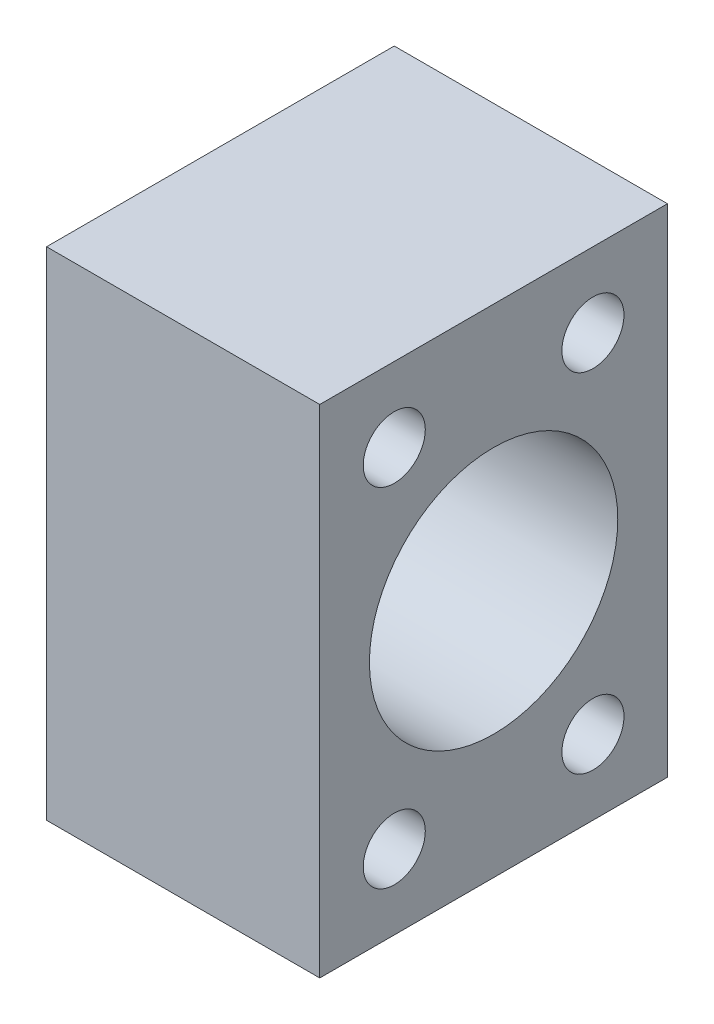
ISO-10303-21;
HEADER;
FILE_DESCRIPTION(('STEP AP214'),'2;1');
FILE_NAME('part.step','',(''),(''),'','','');
FILE_SCHEMA(('AUTOMOTIVE_DESIGN { 1 0 10303 214 1 1 1 1 }'));
ENDSEC;
DATA;
#1=APPLICATION_CONTEXT('core data for automotive mechanical design processes');
#2=APPLICATION_PROTOCOL_DEFINITION('international standard','automotive_design',2000,#1);
#3=PRODUCT_CONTEXT('',#1,'mechanical');
#4=PRODUCT('Part','Part','',(#3));
#5=PRODUCT_RELATED_PRODUCT_CATEGORY('part','',(#4));
#6=PRODUCT_DEFINITION_FORMATION('','',#4);
#7=PRODUCT_DEFINITION_CONTEXT('part definition',#1,'design');
#8=PRODUCT_DEFINITION('design','',#6,#7);
#9=PRODUCT_DEFINITION_SHAPE('','',#8);
#10=(LENGTH_UNIT() NAMED_UNIT(*) SI_UNIT(.MILLI.,.METRE.));
#11=(NAMED_UNIT(*) PLANE_ANGLE_UNIT() SI_UNIT($,.RADIAN.));
#12=(NAMED_UNIT(*) SI_UNIT($,.STERADIAN.) SOLID_ANGLE_UNIT());
#13=UNCERTAINTY_MEASURE_WITH_UNIT(LENGTH_MEASURE(1.E-05),#10,'distance_accuracy_value','');
#14=(GEOMETRIC_REPRESENTATION_CONTEXT(3) GLOBAL_UNCERTAINTY_ASSIGNED_CONTEXT((#13)) GLOBAL_UNIT_ASSIGNED_CONTEXT((#10,
#11,#12)) REPRESENTATION_CONTEXT('',''));
#15=CARTESIAN_POINT('',(0.,0.,0.));
#16=DIRECTION('',(0.,0.,1.));
#17=DIRECTION('',(1.,0.,0.));
#18=AXIS2_PLACEMENT_3D('',#15,#16,#17);
#19=CARTESIAN_POINT('',(17.4625,-31.75,-22.225));
#20=DIRECTION('',(1.,0.,0.));
#21=DIRECTION('',(0.,0.,-1.));
#22=AXIS2_PLACEMENT_3D('',#19,#20,#21);
#23=PLANE('',#22);
#24=CARTESIAN_POINT('',(17.4625,-22.225,12.7));
#25=DIRECTION('',(1.,0.,0.));
#26=DIRECTION('',(0.,0.,-1.));
#27=AXIS2_PLACEMENT_3D('',#24,#25,#26);
#28=CIRCLE('',#27,3.96874999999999);
#29=CARTESIAN_POINT('',(17.4625,-22.225,8.73125000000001));
#30=VERTEX_POINT('',#29);
#31=EDGE_CURVE('E136',#30,#30,#28,.T.);
#32=ORIENTED_EDGE('',*,*,#31,.F.);
#33=EDGE_LOOP('',(#32));
#34=FACE_BOUND('',#33,.T.);
#35=CARTESIAN_POINT('',(17.4625,-22.225,-12.7));
#36=DIRECTION('',(1.,0.,0.));
#37=DIRECTION('',(0.,0.,-1.));
#38=AXIS2_PLACEMENT_3D('',#35,#36,#37);
#39=CIRCLE('',#38,3.96874999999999);
#40=CARTESIAN_POINT('',(17.4625,-22.225,-16.66875));
#41=VERTEX_POINT('',#40);
#42=EDGE_CURVE('E130',#41,#41,#39,.T.);
#43=ORIENTED_EDGE('',*,*,#42,.F.);
#44=EDGE_LOOP('',(#43));
#45=FACE_BOUND('',#44,.T.);
#46=CARTESIAN_POINT('',(17.4625,22.225,-12.7));
#47=DIRECTION('',(1.,0.,0.));
#48=DIRECTION('',(0.,0.,-1.));
#49=AXIS2_PLACEMENT_3D('',#46,#47,#48);
#50=CIRCLE('',#49,3.96874999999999);
#51=CARTESIAN_POINT('',(17.4625,22.225,-16.66875));
#52=VERTEX_POINT('',#51);
#53=EDGE_CURVE('E124',#52,#52,#50,.T.);
#54=ORIENTED_EDGE('',*,*,#53,.F.);
#55=EDGE_LOOP('',(#54));
#56=FACE_BOUND('',#55,.T.);
#57=CARTESIAN_POINT('',(17.4625,22.225,12.7));
#58=DIRECTION('',(1.,0.,0.));
#59=DIRECTION('',(0.,0.,-1.));
#60=AXIS2_PLACEMENT_3D('',#57,#58,#59);
#61=CIRCLE('',#60,3.96874999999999);
#62=CARTESIAN_POINT('',(17.4625,22.225,8.73125000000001));
#63=VERTEX_POINT('',#62);
#64=EDGE_CURVE('E118',#63,#63,#61,.T.);
#65=ORIENTED_EDGE('',*,*,#64,.F.);
#66=EDGE_LOOP('',(#65));
#67=FACE_BOUND('',#66,.T.);
#68=DIRECTION('',(0.,1.,0.));
#69=VECTOR('',#68,1.);
#70=CARTESIAN_POINT('',(17.4625,31.75,-22.225));
#71=LINE('',#70,#69);
#72=CARTESIAN_POINT('',(17.4625,-31.75,-22.225));
#73=VERTEX_POINT('',#72);
#74=CARTESIAN_POINT('',(17.4625,31.75,-22.225));
#75=VERTEX_POINT('',#74);
#76=EDGE_CURVE('E83',#73,#75,#71,.T.);
#77=ORIENTED_EDGE('',*,*,#76,.T.);
#78=DIRECTION('',(0.,0.,1.));
#79=VECTOR('',#78,1.);
#80=CARTESIAN_POINT('',(17.4625,31.75,22.225));
#81=LINE('',#80,#79);
#82=CARTESIAN_POINT('',(17.4625,31.75,22.225));
#83=VERTEX_POINT('',#82);
#84=EDGE_CURVE('E78',#75,#83,#81,.T.);
#85=ORIENTED_EDGE('',*,*,#84,.T.);
#86=DIRECTION('',(0.,-1.,0.));
#87=VECTOR('',#86,1.);
#88=CARTESIAN_POINT('',(17.4625,31.75,22.225));
#89=LINE('',#88,#87);
#90=CARTESIAN_POINT('',(17.4625,-31.75,22.225));
#91=VERTEX_POINT('',#90);
#92=EDGE_CURVE('E81',#83,#91,#89,.T.);
#93=ORIENTED_EDGE('',*,*,#92,.T.);
#94=DIRECTION('',(0.,0.,-1.));
#95=VECTOR('',#94,1.);
#96=CARTESIAN_POINT('',(17.4625,-31.75,22.225));
#97=LINE('',#96,#95);
#98=EDGE_CURVE('E48',#91,#73,#97,.T.);
#99=ORIENTED_EDGE('',*,*,#98,.T.);
#100=EDGE_LOOP('',(#77,#85,#93,#99));
#101=FACE_BOUND('',#100,.T.);
#102=CARTESIAN_POINT('',(17.4625,0.,0.));
#103=DIRECTION('',(1.,0.,0.));
#104=DIRECTION('',(0.,0.,-1.));
#105=AXIS2_PLACEMENT_3D('',#102,#103,#104);
#106=CIRCLE('',#105,15.875);
#107=CARTESIAN_POINT('',(17.4625,0.,-15.875));
#108=VERTEX_POINT('',#107);
#109=EDGE_CURVE('E98',#108,#108,#106,.T.);
#110=ORIENTED_EDGE('',*,*,#109,.F.);
#111=EDGE_LOOP('',(#110));
#112=FACE_BOUND('',#111,.T.);
#113=ADVANCED_FACE('F31',(#34,#45,#56,#67,#101,#112),#23,.T.);
#114=CARTESIAN_POINT('',(-17.4625,-31.75,-22.225));
#115=DIRECTION('',(1.,0.,0.));
#116=DIRECTION('',(0.,0.,-1.));
#117=AXIS2_PLACEMENT_3D('',#114,#115,#116);
#118=PLANE('',#117);
#119=CARTESIAN_POINT('',(-17.4625,-22.225,12.7));
#120=DIRECTION('',(1.,0.,0.));
#121=DIRECTION('',(0.,0.,-1.));
#122=AXIS2_PLACEMENT_3D('',#119,#120,#121);
#123=CIRCLE('',#122,3.96874999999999);
#124=CARTESIAN_POINT('',(-17.4625,-22.225,8.73125));
#125=VERTEX_POINT('',#124);
#126=EDGE_CURVE('E133',#125,#125,#123,.T.);
#127=ORIENTED_EDGE('',*,*,#126,.T.);
#128=EDGE_LOOP('',(#127));
#129=FACE_BOUND('',#128,.T.);
#130=CARTESIAN_POINT('',(-17.4625,-22.225,-12.7));
#131=DIRECTION('',(1.,0.,0.));
#132=DIRECTION('',(0.,0.,-1.));
#133=AXIS2_PLACEMENT_3D('',#130,#131,#132);
#134=CIRCLE('',#133,3.96874999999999);
#135=CARTESIAN_POINT('',(-17.4625,-22.225,-16.66875));
#136=VERTEX_POINT('',#135);
#137=EDGE_CURVE('E127',#136,#136,#134,.T.);
#138=ORIENTED_EDGE('',*,*,#137,.T.);
#139=EDGE_LOOP('',(#138));
#140=FACE_BOUND('',#139,.T.);
#141=CARTESIAN_POINT('',(-17.4625,22.225,-12.7));
#142=DIRECTION('',(1.,0.,0.));
#143=DIRECTION('',(0.,0.,-1.));
#144=AXIS2_PLACEMENT_3D('',#141,#142,#143);
#145=CIRCLE('',#144,3.96874999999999);
#146=CARTESIAN_POINT('',(-17.4625,22.225,-16.66875));
#147=VERTEX_POINT('',#146);
#148=EDGE_CURVE('E121',#147,#147,#145,.T.);
#149=ORIENTED_EDGE('',*,*,#148,.T.);
#150=EDGE_LOOP('',(#149));
#151=FACE_BOUND('',#150,.T.);
#152=CARTESIAN_POINT('',(-17.4625,22.225,12.7));
#153=DIRECTION('',(1.,0.,0.));
#154=DIRECTION('',(0.,0.,-1.));
#155=AXIS2_PLACEMENT_3D('',#152,#153,#154);
#156=CIRCLE('',#155,3.96874999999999);
#157=CARTESIAN_POINT('',(-17.4625,22.225,8.73125));
#158=VERTEX_POINT('',#157);
#159=EDGE_CURVE('E113',#158,#158,#156,.T.);
#160=ORIENTED_EDGE('',*,*,#159,.T.);
#161=EDGE_LOOP('',(#160));
#162=FACE_BOUND('',#161,.T.);
#163=DIRECTION('',(0.,1.,0.));
#164=VECTOR('',#163,1.);
#165=CARTESIAN_POINT('',(-17.4625,31.75,-22.225));
#166=LINE('',#165,#164);
#167=CARTESIAN_POINT('',(-17.4625,-31.75,-22.225));
#168=VERTEX_POINT('',#167);
#169=CARTESIAN_POINT('',(-17.4625,31.75,-22.225));
#170=VERTEX_POINT('',#169);
#171=EDGE_CURVE('E95',#168,#170,#166,.T.);
#172=ORIENTED_EDGE('',*,*,#171,.F.);
#173=DIRECTION('',(0.,0.,-1.));
#174=VECTOR('',#173,1.);
#175=CARTESIAN_POINT('',(-17.4625,-31.75,22.225));
#176=LINE('',#175,#174);
#177=CARTESIAN_POINT('',(-17.4625,-31.75,22.225));
#178=VERTEX_POINT('',#177);
#179=EDGE_CURVE('E71',#178,#168,#176,.T.);
#180=ORIENTED_EDGE('',*,*,#179,.F.);
#181=DIRECTION('',(0.,-1.,0.));
#182=VECTOR('',#181,1.);
#183=CARTESIAN_POINT('',(-17.4625,31.75,22.225));
#184=LINE('',#183,#182);
#185=CARTESIAN_POINT('',(-17.4625,31.75,22.225));
#186=VERTEX_POINT('',#185);
#187=EDGE_CURVE('E65',#186,#178,#184,.T.);
#188=ORIENTED_EDGE('',*,*,#187,.F.);
#189=DIRECTION('',(0.,0.,1.));
#190=VECTOR('',#189,1.);
#191=CARTESIAN_POINT('',(-17.4625,31.75,22.225));
#192=LINE('',#191,#190);
#193=EDGE_CURVE('E87',#170,#186,#192,.T.);
#194=ORIENTED_EDGE('',*,*,#193,.F.);
#195=EDGE_LOOP('',(#172,#180,#188,#194));
#196=FACE_BOUND('',#195,.T.);
#197=CARTESIAN_POINT('',(-17.4625,0.,0.));
#198=DIRECTION('',(1.,0.,0.));
#199=DIRECTION('',(0.,0.,-1.));
#200=AXIS2_PLACEMENT_3D('',#197,#198,#199);
#201=CIRCLE('',#200,15.875);
#202=CARTESIAN_POINT('',(-17.4625,0.,-15.875));
#203=VERTEX_POINT('',#202);
#204=EDGE_CURVE('E110',#203,#203,#201,.T.);
#205=ORIENTED_EDGE('',*,*,#204,.T.);
#206=EDGE_LOOP('',(#205));
#207=FACE_BOUND('',#206,.T.);
#208=ADVANCED_FACE('F106',(#129,#140,#151,#162,#196,#207),#118,.F.);
#209=CARTESIAN_POINT('',(17.4625,31.75,-22.225));
#210=DIRECTION('',(0.,0.,1.));
#211=DIRECTION('',(0.,-1.,0.));
#212=AXIS2_PLACEMENT_3D('',#209,#210,#211);
#213=PLANE('',#212);
#214=ORIENTED_EDGE('',*,*,#171,.T.);
#215=DIRECTION('',(-1.,0.,0.));
#216=VECTOR('',#215,1.);
#217=CARTESIAN_POINT('',(17.4625,31.75,-22.225));
#218=LINE('',#217,#216);
#219=EDGE_CURVE('E11',#75,#170,#218,.T.);
#220=ORIENTED_EDGE('',*,*,#219,.F.);
#221=ORIENTED_EDGE('',*,*,#76,.F.);
#222=DIRECTION('',(-1.,0.,0.));
#223=VECTOR('',#222,1.);
#224=CARTESIAN_POINT('',(17.4625,-31.75,-22.225));
#225=LINE('',#224,#223);
#226=EDGE_CURVE('E91',#73,#168,#225,.T.);
#227=ORIENTED_EDGE('',*,*,#226,.T.);
#228=EDGE_LOOP('',(#214,#220,#221,#227));
#229=FACE_BOUND('',#228,.T.);
#230=ADVANCED_FACE('F33',(#229),#213,.F.);
#231=CARTESIAN_POINT('',(17.4625,31.75,22.225));
#232=DIRECTION('',(0.,-1.,0.));
#233=DIRECTION('',(0.,0.,-1.));
#234=AXIS2_PLACEMENT_3D('',#231,#232,#233);
#235=PLANE('',#234);
#236=ORIENTED_EDGE('',*,*,#193,.T.);
#237=DIRECTION('',(-1.,0.,0.));
#238=VECTOR('',#237,1.);
#239=CARTESIAN_POINT('',(17.4625,31.75,22.225));
#240=LINE('',#239,#238);
#241=EDGE_CURVE('E40',#83,#186,#240,.T.);
#242=ORIENTED_EDGE('',*,*,#241,.F.);
#243=ORIENTED_EDGE('',*,*,#84,.F.);
#244=ORIENTED_EDGE('',*,*,#219,.T.);
#245=EDGE_LOOP('',(#236,#242,#243,#244));
#246=FACE_BOUND('',#245,.T.);
#247=ADVANCED_FACE('F86',(#246),#235,.F.);
#248=CARTESIAN_POINT('',(17.4625,31.75,22.225));
#249=DIRECTION('',(0.,0.,-1.));
#250=DIRECTION('',(-1.,0.,0.));
#251=AXIS2_PLACEMENT_3D('',#248,#249,#250);
#252=PLANE('',#251);
#253=ORIENTED_EDGE('',*,*,#187,.T.);
#254=DIRECTION('',(-1.,0.,0.));
#255=VECTOR('',#254,1.);
#256=CARTESIAN_POINT('',(17.4625,-31.75,22.225));
#257=LINE('',#256,#255);
#258=EDGE_CURVE('E88',#91,#178,#257,.T.);
#259=ORIENTED_EDGE('',*,*,#258,.F.);
#260=ORIENTED_EDGE('',*,*,#92,.F.);
#261=ORIENTED_EDGE('',*,*,#241,.T.);
#262=EDGE_LOOP('',(#253,#259,#260,#261));
#263=FACE_BOUND('',#262,.T.);
#264=ADVANCED_FACE('F89',(#263),#252,.F.);
#265=CARTESIAN_POINT('',(17.4625,-31.75,22.225));
#266=DIRECTION('',(0.,1.,0.));
#267=DIRECTION('',(0.,0.,1.));
#268=AXIS2_PLACEMENT_3D('',#265,#266,#267);
#269=PLANE('',#268);
#270=ORIENTED_EDGE('',*,*,#179,.T.);
#271=ORIENTED_EDGE('',*,*,#226,.F.);
#272=ORIENTED_EDGE('',*,*,#98,.F.);
#273=ORIENTED_EDGE('',*,*,#258,.T.);
#274=EDGE_LOOP('',(#270,#271,#272,#273));
#275=FACE_BOUND('',#274,.T.);
#276=ADVANCED_FACE('F103',(#275),#269,.F.);
#277=CARTESIAN_POINT('',(17.4625,0.,0.));
#278=DIRECTION('',(-1.,0.,0.));
#279=DIRECTION('',(0.,0.,1.));
#280=AXIS2_PLACEMENT_3D('',#277,#278,#279);
#281=CYLINDRICAL_SURFACE('',#280,15.875);
#282=ORIENTED_EDGE('',*,*,#109,.T.);
#283=EDGE_LOOP('',(#282));
#284=FACE_BOUND('',#283,.T.);
#285=ORIENTED_EDGE('',*,*,#204,.F.);
#286=EDGE_LOOP('',(#285));
#287=FACE_BOUND('',#286,.T.);
#288=ADVANCED_FACE('F154',(#284,#287),#281,.F.);
#289=CARTESIAN_POINT('',(17.4625,22.225,12.7));
#290=DIRECTION('',(1.,0.,0.));
#291=DIRECTION('',(0.,0.,-1.));
#292=AXIS2_PLACEMENT_3D('',#289,#290,#291);
#293=CYLINDRICAL_SURFACE('',#292,3.96874999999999);
#294=ORIENTED_EDGE('',*,*,#159,.F.);
#295=EDGE_LOOP('',(#294));
#296=FACE_BOUND('',#295,.T.);
#297=ORIENTED_EDGE('',*,*,#64,.T.);
#298=EDGE_LOOP('',(#297));
#299=FACE_BOUND('',#298,.T.);
#300=ADVANCED_FACE('F151',(#296,#299),#293,.F.);
#301=CARTESIAN_POINT('',(17.4625,22.225,-12.7));
#302=DIRECTION('',(1.,0.,0.));
#303=DIRECTION('',(0.,0.,-1.));
#304=AXIS2_PLACEMENT_3D('',#301,#302,#303);
#305=CYLINDRICAL_SURFACE('',#304,3.96874999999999);
#306=ORIENTED_EDGE('',*,*,#148,.F.);
#307=EDGE_LOOP('',(#306));
#308=FACE_BOUND('',#307,.T.);
#309=ORIENTED_EDGE('',*,*,#53,.T.);
#310=EDGE_LOOP('',(#309));
#311=FACE_BOUND('',#310,.T.);
#312=ADVANCED_FACE('F153',(#308,#311),#305,.F.);
#313=CARTESIAN_POINT('',(17.4625,-22.225,-12.7));
#314=DIRECTION('',(1.,0.,0.));
#315=DIRECTION('',(0.,0.,-1.));
#316=AXIS2_PLACEMENT_3D('',#313,#314,#315);
#317=CYLINDRICAL_SURFACE('',#316,3.96874999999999);
#318=ORIENTED_EDGE('',*,*,#137,.F.);
#319=EDGE_LOOP('',(#318));
#320=FACE_BOUND('',#319,.T.);
#321=ORIENTED_EDGE('',*,*,#42,.T.);
#322=EDGE_LOOP('',(#321));
#323=FACE_BOUND('',#322,.T.);
#324=ADVANCED_FACE('F161',(#320,#323),#317,.F.);
#325=CARTESIAN_POINT('',(17.4625,-22.225,12.7));
#326=DIRECTION('',(1.,0.,0.));
#327=DIRECTION('',(0.,0.,-1.));
#328=AXIS2_PLACEMENT_3D('',#325,#326,#327);
#329=CYLINDRICAL_SURFACE('',#328,3.96874999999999);
#330=ORIENTED_EDGE('',*,*,#126,.F.);
#331=EDGE_LOOP('',(#330));
#332=FACE_BOUND('',#331,.T.);
#333=ORIENTED_EDGE('',*,*,#31,.T.);
#334=EDGE_LOOP('',(#333));
#335=FACE_BOUND('',#334,.T.);
#336=ADVANCED_FACE('F140',(#332,#335),#329,.F.);
#337=CLOSED_SHELL('',(#113,#208,#230,#247,#264,#276,#288,#300,#312,#324,#336));
#338=MANIFOLD_SOLID_BREP('B2',#337);
#339=ADVANCED_BREP_SHAPE_REPRESENTATION('',(#18,#338),#14);
#340=SHAPE_DEFINITION_REPRESENTATION(#9,#339);
ENDSEC;
END-ISO-10303-21;
